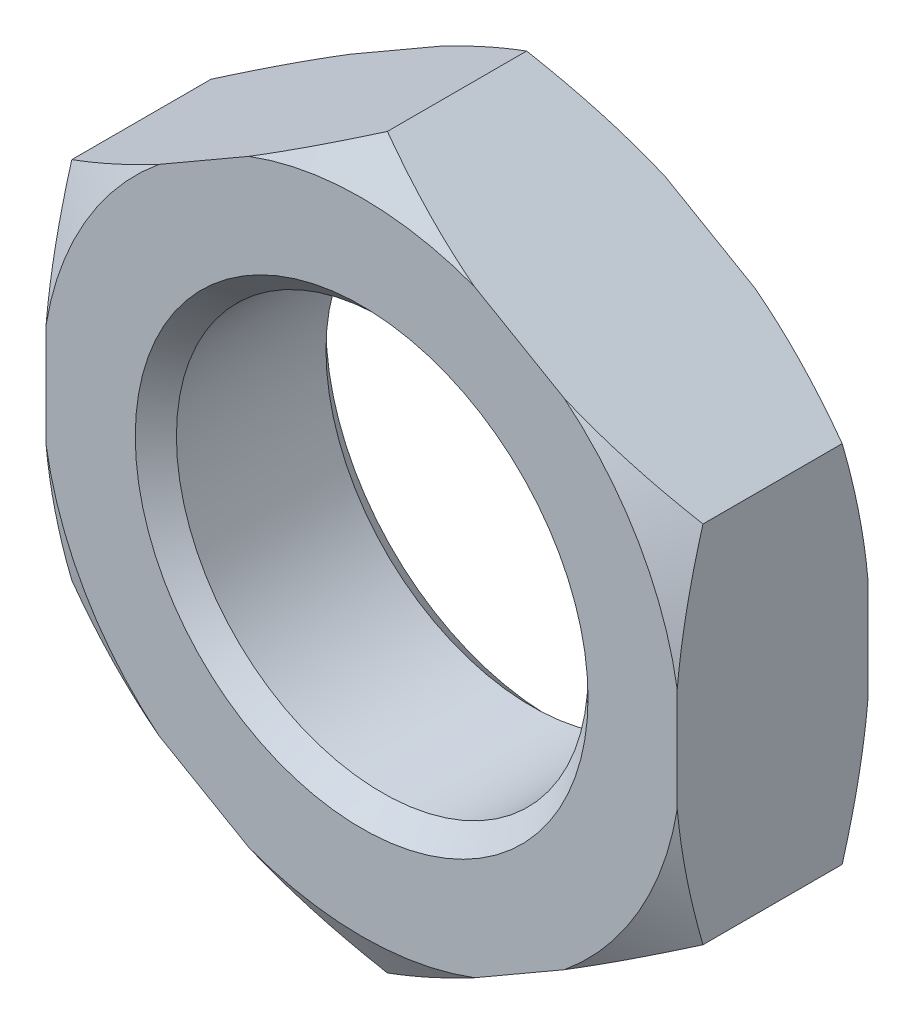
from build123d import *

# Parameters (mm, degrees)
BOSS_EXTRUDE1_DEPTH = 6.95
SKETCH6_R           = 15
CUT_EXTRUDE1_DEPTH  = 13.9
CHAMFER1_SIZE       = 1.5


with BuildPart() as part:
    # Sketch3 → Boss-Extrude1 (new, symmetric)
    with BuildSketch(Plane.XY):
        Polygon((0, 26.558112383), (-23, 13.279056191), (-23, -13.279056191), (0, -26.558112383), (23, -13.279056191), (23, 13.279056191), align=None)
    extrude(amount=BOSS_EXTRUDE1_DEPTH, both=True)

    # Sketch5 → Cut-Revolve1 (revolve, cut)
    with BuildSketch(Plane(origin=(0, 0, 0), x_dir=(0, 0, -1), z_dir=(1, 0, 0))):
        Polygon((-6.95, 26.558112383), (-6.95, 23.308112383), (-5.073611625, 26.558112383), align=None)
    cut_revolve1 = revolve(axis=Axis((0, 0, 5.457798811), (0, 0, -1)), mode=Mode.SUBTRACT)

    # Mirror1: Cut-Revolve1 across plane
    add(cut_revolve1.mirror(Plane.XY), mode=Mode.SUBTRACT)

    # Sketch6 → Cut-Extrude1 (cut)
    with BuildSketch(Plane.XY.offset(6.95)):
        Circle(SKETCH6_R)
    extrude(amount=-CUT_EXTRUDE1_DEPTH, mode=Mode.SUBTRACT)

    # Chamfer1
    chamfer1_edges = [part.edges().sort_by_distance(p)[0] for p in [
        (-15, 0, -6.95),
        (-15, 0, 6.95),
    ]]
    chamfer(chamfer1_edges, length=CHAMFER1_SIZE)


solid = part.part
